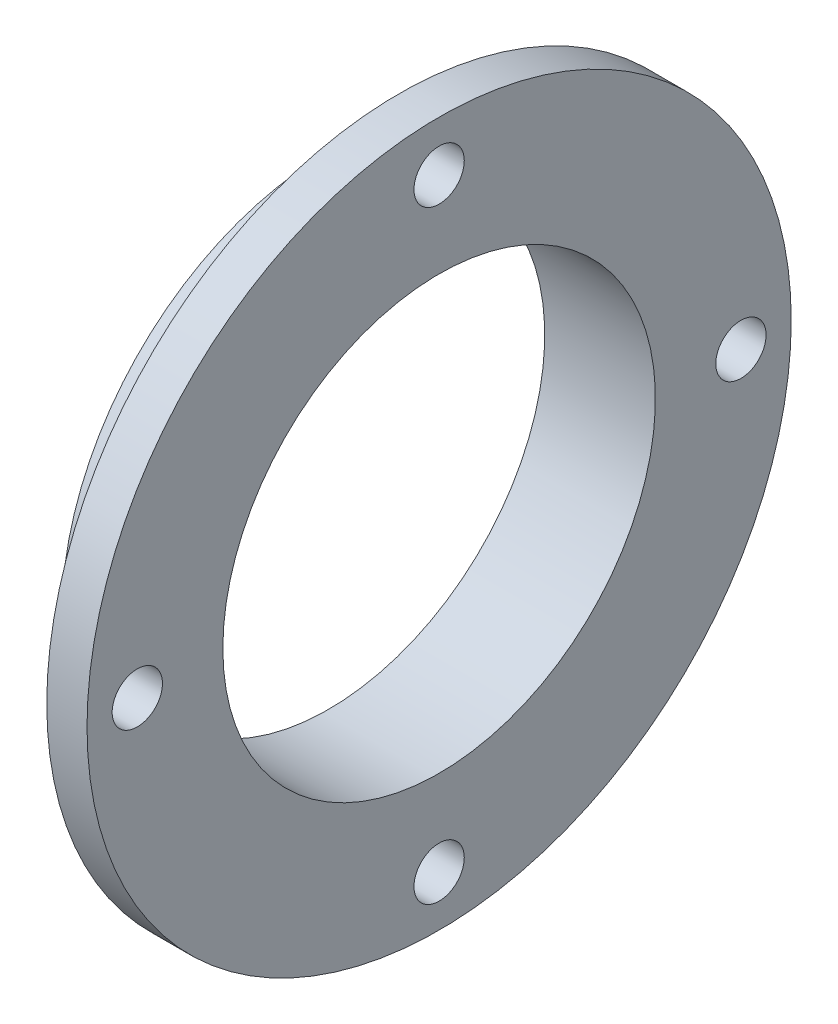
ISO-10303-21;
HEADER;
FILE_DESCRIPTION(('STEP AP214'),'2;1');
FILE_NAME('part.step','',(''),(''),'','','');
FILE_SCHEMA(('AUTOMOTIVE_DESIGN { 1 0 10303 214 1 1 1 1 }'));
ENDSEC;
DATA;
#1=APPLICATION_CONTEXT('core data for automotive mechanical design processes');
#2=APPLICATION_PROTOCOL_DEFINITION('international standard','automotive_design',2000,#1);
#3=PRODUCT_CONTEXT('',#1,'mechanical');
#4=PRODUCT('Part','Part','',(#3));
#5=PRODUCT_RELATED_PRODUCT_CATEGORY('part','',(#4));
#6=PRODUCT_DEFINITION_FORMATION('','',#4);
#7=PRODUCT_DEFINITION_CONTEXT('part definition',#1,'design');
#8=PRODUCT_DEFINITION('design','',#6,#7);
#9=PRODUCT_DEFINITION_SHAPE('','',#8);
#10=(LENGTH_UNIT() NAMED_UNIT(*) SI_UNIT(.MILLI.,.METRE.));
#11=(NAMED_UNIT(*) PLANE_ANGLE_UNIT() SI_UNIT($,.RADIAN.));
#12=(NAMED_UNIT(*) SI_UNIT($,.STERADIAN.) SOLID_ANGLE_UNIT());
#13=UNCERTAINTY_MEASURE_WITH_UNIT(LENGTH_MEASURE(1.E-05),#10,'distance_accuracy_value','');
#14=(GEOMETRIC_REPRESENTATION_CONTEXT(3) GLOBAL_UNCERTAINTY_ASSIGNED_CONTEXT((#13)) GLOBAL_UNIT_ASSIGNED_CONTEXT((#10,
#11,#12)) REPRESENTATION_CONTEXT('',''));
#15=CARTESIAN_POINT('',(0.,0.,0.));
#16=DIRECTION('',(0.,0.,1.));
#17=DIRECTION('',(1.,0.,0.));
#18=AXIS2_PLACEMENT_3D('',#15,#16,#17);
#19=CARTESIAN_POINT('',(0.,53.,0.));
#20=DIRECTION('',(1.,0.,0.));
#21=DIRECTION('',(0.,0.,-1.));
#22=AXIS2_PLACEMENT_3D('',#19,#20,#21);
#23=PLANE('',#22);
#24=CARTESIAN_POINT('',(0.,0.,0.));
#25=DIRECTION('',(-1.,0.,0.));
#26=DIRECTION('',(0.,0.,1.));
#27=AXIS2_PLACEMENT_3D('',#24,#25,#26);
#28=CIRCLE('',#27,43.);
#29=CARTESIAN_POINT('',(0.,0.,43.));
#30=VERTEX_POINT('',#29);
#31=EDGE_CURVE('E10',#30,#30,#28,.T.);
#32=ORIENTED_EDGE('',*,*,#31,.F.);
#33=EDGE_LOOP('',(#32));
#34=FACE_BOUND('',#33,.T.);
#35=CARTESIAN_POINT('',(0.,0.,0.));
#36=DIRECTION('',(-1.,0.,0.));
#37=DIRECTION('',(0.,0.,1.));
#38=AXIS2_PLACEMENT_3D('',#35,#36,#37);
#39=CIRCLE('',#38,53.);
#40=CARTESIAN_POINT('',(0.,0.,53.));
#41=VERTEX_POINT('',#40);
#42=EDGE_CURVE('E52',#41,#41,#39,.T.);
#43=ORIENTED_EDGE('',*,*,#42,.T.);
#44=EDGE_LOOP('',(#43));
#45=FACE_BOUND('',#44,.T.);
#46=ADVANCED_FACE('F30',(#34,#45),#23,.F.);
#47=CARTESIAN_POINT('',(0.,0.,0.));
#48=DIRECTION('',(-1.,0.,0.));
#49=DIRECTION('',(0.,0.,1.));
#50=AXIS2_PLACEMENT_3D('',#47,#48,#49);
#51=CYLINDRICAL_SURFACE('',#50,43.);
#52=CARTESIAN_POINT('',(22.,0.,0.));
#53=DIRECTION('',(-1.,0.,0.));
#54=DIRECTION('',(0.,0.,1.));
#55=AXIS2_PLACEMENT_3D('',#52,#53,#54);
#56=CIRCLE('',#55,43.);
#57=CARTESIAN_POINT('',(22.,0.,43.));
#58=VERTEX_POINT('',#57);
#59=EDGE_CURVE('E37',#58,#58,#56,.T.);
#60=ORIENTED_EDGE('',*,*,#59,.F.);
#61=EDGE_LOOP('',(#60));
#62=FACE_BOUND('',#61,.T.);
#63=ORIENTED_EDGE('',*,*,#31,.T.);
#64=EDGE_LOOP('',(#63));
#65=FACE_BOUND('',#64,.T.);
#66=ADVANCED_FACE('F84',(#62,#65),#51,.F.);
#67=CARTESIAN_POINT('',(22.,43.,0.));
#68=DIRECTION('',(-1.,0.,0.));
#69=DIRECTION('',(0.,0.,1.));
#70=AXIS2_PLACEMENT_3D('',#67,#68,#69);
#71=PLANE('',#70);
#72=CARTESIAN_POINT('',(22.,6.27709937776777E-13,60.));
#73=DIRECTION('',(1.,0.,0.));
#74=DIRECTION('',(0.,0.,-1.));
#75=AXIS2_PLACEMENT_3D('',#72,#73,#74);
#76=CIRCLE('',#75,4.99999999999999);
#77=CARTESIAN_POINT('',(22.,6.27709937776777E-13,55.));
#78=VERTEX_POINT('',#77);
#79=EDGE_CURVE('E73',#78,#78,#76,.T.);
#80=ORIENTED_EDGE('',*,*,#79,.F.);
#81=EDGE_LOOP('',(#80));
#82=FACE_BOUND('',#81,.T.);
#83=CARTESIAN_POINT('',(22.,-60.,0.));
#84=DIRECTION('',(1.,0.,0.));
#85=DIRECTION('',(0.,0.,-1.));
#86=AXIS2_PLACEMENT_3D('',#83,#84,#85);
#87=CIRCLE('',#86,4.99999999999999);
#88=CARTESIAN_POINT('',(22.,-60.,-4.99999999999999));
#89=VERTEX_POINT('',#88);
#90=EDGE_CURVE('E67',#89,#89,#87,.T.);
#91=ORIENTED_EDGE('',*,*,#90,.F.);
#92=EDGE_LOOP('',(#91));
#93=FACE_BOUND('',#92,.T.);
#94=CARTESIAN_POINT('',(22.,-2.08732177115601E-13,-60.));
#95=DIRECTION('',(1.,0.,0.));
#96=DIRECTION('',(0.,0.,-1.));
#97=AXIS2_PLACEMENT_3D('',#94,#95,#96);
#98=CIRCLE('',#97,4.99999999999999);
#99=CARTESIAN_POINT('',(22.,-2.08732177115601E-13,-65.));
#100=VERTEX_POINT('',#99);
#101=EDGE_CURVE('E64',#100,#100,#98,.T.);
#102=ORIENTED_EDGE('',*,*,#101,.F.);
#103=EDGE_LOOP('',(#102));
#104=FACE_BOUND('',#103,.T.);
#105=CARTESIAN_POINT('',(22.,60.,0.));
#106=DIRECTION('',(1.,0.,0.));
#107=DIRECTION('',(0.,0.,-1.));
#108=AXIS2_PLACEMENT_3D('',#105,#106,#107);
#109=CIRCLE('',#108,4.99999999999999);
#110=CARTESIAN_POINT('',(22.,60.,-4.99999999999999));
#111=VERTEX_POINT('',#110);
#112=EDGE_CURVE('E58',#111,#111,#109,.T.);
#113=ORIENTED_EDGE('',*,*,#112,.F.);
#114=EDGE_LOOP('',(#113));
#115=FACE_BOUND('',#114,.T.);
#116=CARTESIAN_POINT('',(22.,0.,0.));
#117=DIRECTION('',(-1.,0.,0.));
#118=DIRECTION('',(0.,0.,1.));
#119=AXIS2_PLACEMENT_3D('',#116,#117,#118);
#120=CIRCLE('',#119,70.);
#121=CARTESIAN_POINT('',(22.,0.,70.));
#122=VERTEX_POINT('',#121);
#123=EDGE_CURVE('E41',#122,#122,#120,.T.);
#124=ORIENTED_EDGE('',*,*,#123,.F.);
#125=EDGE_LOOP('',(#124));
#126=FACE_BOUND('',#125,.T.);
#127=ORIENTED_EDGE('',*,*,#59,.T.);
#128=EDGE_LOOP('',(#127));
#129=FACE_BOUND('',#128,.T.);
#130=ADVANCED_FACE('F80',(#82,#93,#104,#115,#126,#129),#71,.F.);
#131=CARTESIAN_POINT('',(0.,0.,0.));
#132=DIRECTION('',(-1.,0.,0.));
#133=DIRECTION('',(0.,0.,1.));
#134=AXIS2_PLACEMENT_3D('',#131,#132,#133);
#135=CYLINDRICAL_SURFACE('',#134,70.);
#136=CARTESIAN_POINT('',(14.,0.,0.));
#137=DIRECTION('',(-1.,0.,0.));
#138=DIRECTION('',(0.,0.,1.));
#139=AXIS2_PLACEMENT_3D('',#136,#137,#138);
#140=CIRCLE('',#139,70.);
#141=CARTESIAN_POINT('',(14.,0.,70.));
#142=VERTEX_POINT('',#141);
#143=EDGE_CURVE('E46',#142,#142,#140,.T.);
#144=ORIENTED_EDGE('',*,*,#143,.F.);
#145=EDGE_LOOP('',(#144));
#146=FACE_BOUND('',#145,.T.);
#147=ORIENTED_EDGE('',*,*,#123,.T.);
#148=EDGE_LOOP('',(#147));
#149=FACE_BOUND('',#148,.T.);
#150=ADVANCED_FACE('F83',(#146,#149),#135,.T.);
#151=CARTESIAN_POINT('',(14.,70.,0.));
#152=DIRECTION('',(1.,0.,0.));
#153=DIRECTION('',(0.,0.,-1.));
#154=AXIS2_PLACEMENT_3D('',#151,#152,#153);
#155=PLANE('',#154);
#156=CARTESIAN_POINT('',(14.,6.27709937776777E-13,60.));
#157=DIRECTION('',(1.,0.,0.));
#158=DIRECTION('',(0.,0.,-1.));
#159=AXIS2_PLACEMENT_3D('',#156,#157,#158);
#160=CIRCLE('',#159,4.99999999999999);
#161=CARTESIAN_POINT('',(14.,6.27709937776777E-13,55.));
#162=VERTEX_POINT('',#161);
#163=EDGE_CURVE('E70',#162,#162,#160,.T.);
#164=ORIENTED_EDGE('',*,*,#163,.T.);
#165=EDGE_LOOP('',(#164));
#166=FACE_BOUND('',#165,.T.);
#167=CARTESIAN_POINT('',(14.,-60.,0.));
#168=DIRECTION('',(1.,0.,0.));
#169=DIRECTION('',(0.,0.,-1.));
#170=AXIS2_PLACEMENT_3D('',#167,#168,#169);
#171=CIRCLE('',#170,4.99999999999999);
#172=CARTESIAN_POINT('',(14.,-60.,-4.99999999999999));
#173=VERTEX_POINT('',#172);
#174=EDGE_CURVE('E33',#173,#173,#171,.T.);
#175=ORIENTED_EDGE('',*,*,#174,.T.);
#176=EDGE_LOOP('',(#175));
#177=FACE_BOUND('',#176,.T.);
#178=CARTESIAN_POINT('',(14.,-2.08732177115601E-13,-60.));
#179=DIRECTION('',(1.,0.,0.));
#180=DIRECTION('',(0.,0.,-1.));
#181=AXIS2_PLACEMENT_3D('',#178,#179,#180);
#182=CIRCLE('',#181,4.99999999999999);
#183=CARTESIAN_POINT('',(14.,-2.08732177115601E-13,-65.));
#184=VERTEX_POINT('',#183);
#185=EDGE_CURVE('E61',#184,#184,#182,.T.);
#186=ORIENTED_EDGE('',*,*,#185,.T.);
#187=EDGE_LOOP('',(#186));
#188=FACE_BOUND('',#187,.T.);
#189=CARTESIAN_POINT('',(14.,60.,0.));
#190=DIRECTION('',(1.,0.,0.));
#191=DIRECTION('',(0.,0.,-1.));
#192=AXIS2_PLACEMENT_3D('',#189,#190,#191);
#193=CIRCLE('',#192,4.99999999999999);
#194=CARTESIAN_POINT('',(14.,60.,-4.99999999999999));
#195=VERTEX_POINT('',#194);
#196=EDGE_CURVE('E55',#195,#195,#193,.T.);
#197=ORIENTED_EDGE('',*,*,#196,.T.);
#198=EDGE_LOOP('',(#197));
#199=FACE_BOUND('',#198,.T.);
#200=CARTESIAN_POINT('',(14.,0.,0.));
#201=DIRECTION('',(-1.,0.,0.));
#202=DIRECTION('',(0.,0.,1.));
#203=AXIS2_PLACEMENT_3D('',#200,#201,#202);
#204=CIRCLE('',#203,53.);
#205=CARTESIAN_POINT('',(14.,0.,53.));
#206=VERTEX_POINT('',#205);
#207=EDGE_CURVE('E49',#206,#206,#204,.T.);
#208=ORIENTED_EDGE('',*,*,#207,.F.);
#209=EDGE_LOOP('',(#208));
#210=FACE_BOUND('',#209,.T.);
#211=ORIENTED_EDGE('',*,*,#143,.T.);
#212=EDGE_LOOP('',(#211));
#213=FACE_BOUND('',#212,.T.);
#214=ADVANCED_FACE('F104',(#166,#177,#188,#199,#210,#213),#155,.F.);
#215=CARTESIAN_POINT('',(0.,0.,0.));
#216=DIRECTION('',(-1.,0.,0.));
#217=DIRECTION('',(0.,0.,1.));
#218=AXIS2_PLACEMENT_3D('',#215,#216,#217);
#219=CYLINDRICAL_SURFACE('',#218,53.);
#220=ORIENTED_EDGE('',*,*,#42,.F.);
#221=EDGE_LOOP('',(#220));
#222=FACE_BOUND('',#221,.T.);
#223=ORIENTED_EDGE('',*,*,#207,.T.);
#224=EDGE_LOOP('',(#223));
#225=FACE_BOUND('',#224,.T.);
#226=ADVANCED_FACE('F108',(#222,#225),#219,.T.);
#227=CARTESIAN_POINT('',(22.,60.,0.));
#228=DIRECTION('',(1.,0.,0.));
#229=DIRECTION('',(0.,0.,-1.));
#230=AXIS2_PLACEMENT_3D('',#227,#228,#229);
#231=CYLINDRICAL_SURFACE('',#230,4.99999999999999);
#232=ORIENTED_EDGE('',*,*,#112,.T.);
#233=EDGE_LOOP('',(#232));
#234=FACE_BOUND('',#233,.T.);
#235=ORIENTED_EDGE('',*,*,#196,.F.);
#236=EDGE_LOOP('',(#235));
#237=FACE_BOUND('',#236,.T.);
#238=ADVANCED_FACE('F112',(#234,#237),#231,.F.);
#239=CARTESIAN_POINT('',(22.,-2.08732177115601E-13,-60.));
#240=DIRECTION('',(1.,0.,0.));
#241=DIRECTION('',(0.,0.,-1.));
#242=AXIS2_PLACEMENT_3D('',#239,#240,#241);
#243=CYLINDRICAL_SURFACE('',#242,4.99999999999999);
#244=ORIENTED_EDGE('',*,*,#101,.T.);
#245=EDGE_LOOP('',(#244));
#246=FACE_BOUND('',#245,.T.);
#247=ORIENTED_EDGE('',*,*,#185,.F.);
#248=EDGE_LOOP('',(#247));
#249=FACE_BOUND('',#248,.T.);
#250=ADVANCED_FACE('F116',(#246,#249),#243,.F.);
#251=CARTESIAN_POINT('',(22.,-60.,0.));
#252=DIRECTION('',(1.,0.,0.));
#253=DIRECTION('',(0.,0.,-1.));
#254=AXIS2_PLACEMENT_3D('',#251,#252,#253);
#255=CYLINDRICAL_SURFACE('',#254,4.99999999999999);
#256=ORIENTED_EDGE('',*,*,#90,.T.);
#257=EDGE_LOOP('',(#256));
#258=FACE_BOUND('',#257,.T.);
#259=ORIENTED_EDGE('',*,*,#174,.F.);
#260=EDGE_LOOP('',(#259));
#261=FACE_BOUND('',#260,.T.);
#262=ADVANCED_FACE('F120',(#258,#261),#255,.F.);
#263=CARTESIAN_POINT('',(22.,6.27709937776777E-13,60.));
#264=DIRECTION('',(1.,0.,0.));
#265=DIRECTION('',(0.,0.,-1.));
#266=AXIS2_PLACEMENT_3D('',#263,#264,#265);
#267=CYLINDRICAL_SURFACE('',#266,4.99999999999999);
#268=ORIENTED_EDGE('',*,*,#79,.T.);
#269=EDGE_LOOP('',(#268));
#270=FACE_BOUND('',#269,.T.);
#271=ORIENTED_EDGE('',*,*,#163,.F.);
#272=EDGE_LOOP('',(#271));
#273=FACE_BOUND('',#272,.T.);
#274=ADVANCED_FACE('F77',(#270,#273),#267,.F.);
#275=CLOSED_SHELL('',(#46,#66,#130,#150,#214,#226,#238,#250,#262,#274));
#276=MANIFOLD_SOLID_BREP('B2',#275);
#277=ADVANCED_BREP_SHAPE_REPRESENTATION('',(#18,#276),#14);
#278=SHAPE_DEFINITION_REPRESENTATION(#9,#277);
ENDSEC;
END-ISO-10303-21;
